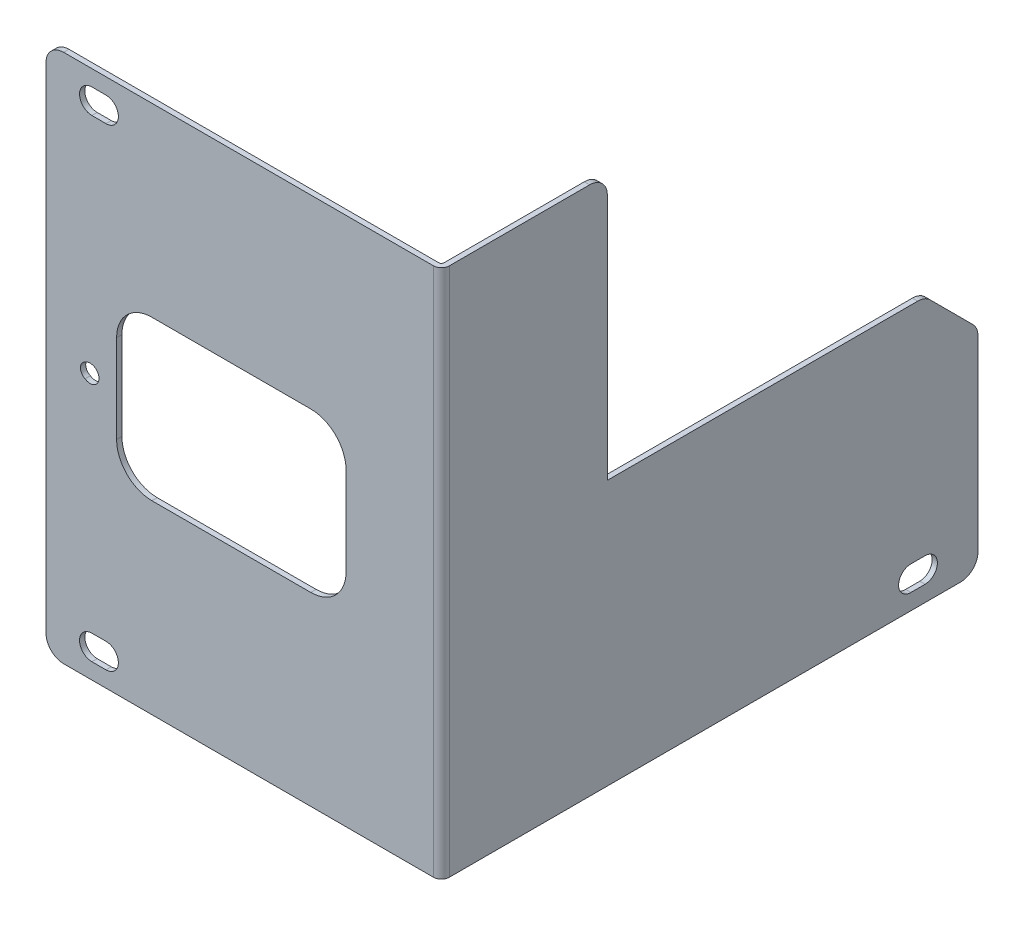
ISO-10303-21;
HEADER;
FILE_DESCRIPTION(('STEP AP214'),'2;1');
FILE_NAME('part.step','',(''),(''),'','','');
FILE_SCHEMA(('AUTOMOTIVE_DESIGN { 1 0 10303 214 1 1 1 1 }'));
ENDSEC;
DATA;
#1=APPLICATION_CONTEXT('core data for automotive mechanical design processes');
#2=APPLICATION_PROTOCOL_DEFINITION('international standard','automotive_design',2000,#1);
#3=PRODUCT_CONTEXT('',#1,'mechanical');
#4=PRODUCT('Part','Part','',(#3));
#5=PRODUCT_RELATED_PRODUCT_CATEGORY('part','',(#4));
#6=PRODUCT_DEFINITION_FORMATION('','',#4);
#7=PRODUCT_DEFINITION_CONTEXT('part definition',#1,'design');
#8=PRODUCT_DEFINITION('design','',#6,#7);
#9=PRODUCT_DEFINITION_SHAPE('','',#8);
#10=(LENGTH_UNIT() NAMED_UNIT(*) SI_UNIT(.MILLI.,.METRE.));
#11=(NAMED_UNIT(*) PLANE_ANGLE_UNIT() SI_UNIT($,.RADIAN.));
#12=(NAMED_UNIT(*) SI_UNIT($,.STERADIAN.) SOLID_ANGLE_UNIT());
#13=UNCERTAINTY_MEASURE_WITH_UNIT(LENGTH_MEASURE(1.E-05),#10,'distance_accuracy_value','');
#14=(GEOMETRIC_REPRESENTATION_CONTEXT(3) GLOBAL_UNCERTAINTY_ASSIGNED_CONTEXT((#13)) GLOBAL_UNIT_ASSIGNED_CONTEXT((#10,
#11,#12)) REPRESENTATION_CONTEXT('',''));
#15=CARTESIAN_POINT('',(0.,0.,0.));
#16=DIRECTION('',(0.,0.,1.));
#17=DIRECTION('',(1.,0.,0.));
#18=AXIS2_PLACEMENT_3D('',#15,#16,#17);
#19=CARTESIAN_POINT('',(0.,0.,0.));
#20=DIRECTION('',(1.,0.,0.));
#21=DIRECTION('',(0.,0.,-1.));
#22=AXIS2_PLACEMENT_3D('',#19,#20,#21);
#23=PLANE('',#22);
#24=DIRECTION('',(0.,0.,-1.));
#25=VECTOR('',#24,1.);
#26=CARTESIAN_POINT('',(0.,-63.5,-131.5));
#27=LINE('',#26,#25);
#28=CARTESIAN_POINT('',(0.,-63.5,-131.5));
#29=VERTEX_POINT('',#28);
#30=CARTESIAN_POINT('',(0.,-63.5,-135.5));
#31=VERTEX_POINT('',#30);
#32=EDGE_CURVE('E891',#29,#31,#27,.T.);
#33=ORIENTED_EDGE('',*,*,#32,.F.);
#34=CARTESIAN_POINT('',(0.,-67.,-131.5));
#35=DIRECTION('',(-1.,0.,0.));
#36=DIRECTION('',(0.,0.,1.));
#37=AXIS2_PLACEMENT_3D('',#34,#35,#36);
#38=CIRCLE('',#37,3.5);
#39=CARTESIAN_POINT('',(0.,-70.5,-131.5));
#40=VERTEX_POINT('',#39);
#41=EDGE_CURVE('E888',#40,#29,#38,.T.);
#42=ORIENTED_EDGE('',*,*,#41,.F.);
#43=DIRECTION('',(0.,0.,1.));
#44=VECTOR('',#43,1.);
#45=CARTESIAN_POINT('',(0.,-70.5,-135.5));
#46=LINE('',#45,#44);
#47=CARTESIAN_POINT('',(0.,-70.5,-135.5));
#48=VERTEX_POINT('',#47);
#49=EDGE_CURVE('E889',#48,#40,#46,.T.);
#50=ORIENTED_EDGE('',*,*,#49,.F.);
#51=CARTESIAN_POINT('',(0.,-67.,-135.5));
#52=DIRECTION('',(-1.,0.,0.));
#53=DIRECTION('',(0.,0.,1.));
#54=AXIS2_PLACEMENT_3D('',#51,#52,#53);
#55=CIRCLE('',#54,3.5);
#56=EDGE_CURVE('E879',#31,#48,#55,.T.);
#57=ORIENTED_EDGE('',*,*,#56,.F.);
#58=EDGE_LOOP('',(#33,#42,#50,#57));
#59=FACE_BOUND('',#58,.T.);
#60=DIRECTION('',(0.,0.,1.));
#61=VECTOR('',#60,1.);
#62=CARTESIAN_POINT('',(0.,75.,1.50000000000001));
#63=LINE('',#62,#61);
#64=CARTESIAN_POINT('',(0.,75.,-40.5));
#65=VERTEX_POINT('',#64);
#66=CARTESIAN_POINT('',(0.,75.,-0.75));
#67=VERTEX_POINT('',#66);
#68=EDGE_CURVE('E327',#65,#67,#63,.T.);
#69=ORIENTED_EDGE('',*,*,#68,.F.);
#70=CARTESIAN_POINT('',(0.,70.,-40.5));
#71=DIRECTION('',(1.,0.,0.));
#72=DIRECTION('',(0.,0.,-1.));
#73=AXIS2_PLACEMENT_3D('',#70,#71,#72);
#74=CIRCLE('',#73,5.);
#75=CARTESIAN_POINT('',(0.,70.,-45.5));
#76=VERTEX_POINT('',#75);
#77=EDGE_CURVE('E909',#65,#76,#74,.F.);
#78=ORIENTED_EDGE('',*,*,#77,.T.);
#79=DIRECTION('',(0.,-1.,0.));
#80=VECTOR('',#79,1.);
#81=CARTESIAN_POINT('',(0.,75.,-45.5));
#82=LINE('',#81,#80);
#83=CARTESIAN_POINT('',(0.,0.,-45.5));
#84=VERTEX_POINT('',#83);
#85=EDGE_CURVE('E335',#76,#84,#82,.T.);
#86=ORIENTED_EDGE('',*,*,#85,.T.);
#87=DIRECTION('',(0.,0.,1.));
#88=VECTOR('',#87,1.);
#89=CARTESIAN_POINT('',(0.,0.,-135.5));
#90=LINE('',#89,#88);
#91=CARTESIAN_POINT('',(0.,0.,-133.428932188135));
#92=VERTEX_POINT('',#91);
#93=EDGE_CURVE('E367',#92,#84,#90,.T.);
#94=ORIENTED_EDGE('',*,*,#93,.F.);
#95=CARTESIAN_POINT('',(0.,-4.99999999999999,-133.428932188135));
#96=DIRECTION('',(1.,0.,0.));
#97=DIRECTION('',(0.,0.,-1.));
#98=AXIS2_PLACEMENT_3D('',#95,#96,#97);
#99=CIRCLE('',#98,5.);
#100=CARTESIAN_POINT('',(0.,-1.46446609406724,-136.964466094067));
#101=VERTEX_POINT('',#100);
#102=EDGE_CURVE('E913',#92,#101,#99,.F.);
#103=ORIENTED_EDGE('',*,*,#102,.T.);
#104=DIRECTION('',(0.,0.707106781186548,0.707106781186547));
#105=VECTOR('',#104,1.);
#106=CARTESIAN_POINT('',(0.,-15.,-150.5));
#107=LINE('',#106,#105);
#108=CARTESIAN_POINT('',(0.,-13.5355339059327,-149.035533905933));
#109=VERTEX_POINT('',#108);
#110=EDGE_CURVE('E931',#109,#101,#107,.T.);
#111=ORIENTED_EDGE('',*,*,#110,.F.);
#112=CARTESIAN_POINT('',(0.,-17.0710678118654,-145.5));
#113=DIRECTION('',(1.,0.,0.));
#114=DIRECTION('',(0.,0.,-1.));
#115=AXIS2_PLACEMENT_3D('',#112,#113,#114);
#116=CIRCLE('',#115,5.);
#117=CARTESIAN_POINT('',(0.,-17.0710678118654,-150.5));
#118=VERTEX_POINT('',#117);
#119=EDGE_CURVE('E925',#109,#118,#116,.F.);
#120=ORIENTED_EDGE('',*,*,#119,.T.);
#121=DIRECTION('',(0.,1.,0.));
#122=VECTOR('',#121,1.);
#123=CARTESIAN_POINT('',(0.,-75.,-150.5));
#124=LINE('',#123,#122);
#125=CARTESIAN_POINT('',(0.,-70.,-150.5));
#126=VERTEX_POINT('',#125);
#127=EDGE_CURVE('E366',#126,#118,#124,.T.);
#128=ORIENTED_EDGE('',*,*,#127,.F.);
#129=CARTESIAN_POINT('',(0.,-70.,-145.5));
#130=DIRECTION('',(1.,0.,0.));
#131=DIRECTION('',(0.,0.,-1.));
#132=AXIS2_PLACEMENT_3D('',#129,#130,#131);
#133=CIRCLE('',#132,5.);
#134=CARTESIAN_POINT('',(0.,-75.,-145.5));
#135=VERTEX_POINT('',#134);
#136=EDGE_CURVE('E912',#126,#135,#133,.F.);
#137=ORIENTED_EDGE('',*,*,#136,.T.);
#138=DIRECTION('',(0.,0.,-1.));
#139=VECTOR('',#138,1.);
#140=CARTESIAN_POINT('',(0.,-75.,1.5));
#141=LINE('',#140,#139);
#142=CARTESIAN_POINT('',(0.,-75.,-0.75));
#143=VERTEX_POINT('',#142);
#144=EDGE_CURVE('E362',#143,#135,#141,.T.);
#145=ORIENTED_EDGE('',*,*,#144,.F.);
#146=DIRECTION('',(0.,-1.,0.));
#147=VECTOR('',#146,1.);
#148=CARTESIAN_POINT('',(0.,75.,-0.75));
#149=LINE('',#148,#147);
#150=EDGE_CURVE('E361',#143,#67,#149,.F.);
#151=ORIENTED_EDGE('',*,*,#150,.T.);
#152=EDGE_LOOP('',(#69,#78,#86,#94,#103,#111,#120,#128,#137,#145,#151));
#153=FACE_BOUND('',#152,.T.);
#154=ADVANCED_FACE('F32',(#59,#153),#23,.F.);
#155=CARTESIAN_POINT('',(0.,-15.,-150.5));
#156=DIRECTION('',(0.,0.707106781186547,-0.707106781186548));
#157=DIRECTION('',(0.,0.707106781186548,0.707106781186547));
#158=AXIS2_PLACEMENT_3D('',#155,#156,#157);
#159=PLANE('',#158);
#160=DIRECTION('',(0.,0.707106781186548,0.707106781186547));
#161=VECTOR('',#160,1.);
#162=CARTESIAN_POINT('',(1.5,-15.,-150.5));
#163=LINE('',#162,#161);
#164=CARTESIAN_POINT('',(1.5,-13.5355339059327,-149.035533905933));
#165=VERTEX_POINT('',#164);
#166=CARTESIAN_POINT('',(1.5,-1.46446609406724,-136.964466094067));
#167=VERTEX_POINT('',#166);
#168=EDGE_CURVE('E375',#165,#167,#163,.T.);
#169=ORIENTED_EDGE('',*,*,#168,.F.);
#170=DIRECTION('',(1.,0.,0.));
#171=VECTOR('',#170,1.);
#172=CARTESIAN_POINT('',(0.,-13.5355339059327,-149.035533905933));
#173=LINE('',#172,#171);
#174=EDGE_CURVE('E405',#165,#109,#173,.F.);
#175=ORIENTED_EDGE('',*,*,#174,.T.);
#176=ORIENTED_EDGE('',*,*,#110,.T.);
#177=DIRECTION('',(1.,0.,0.));
#178=VECTOR('',#177,1.);
#179=CARTESIAN_POINT('',(0.,-1.46446609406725,-136.964466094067));
#180=LINE('',#179,#178);
#181=EDGE_CURVE('E402',#101,#167,#180,.T.);
#182=ORIENTED_EDGE('',*,*,#181,.T.);
#183=EDGE_LOOP('',(#169,#175,#176,#182));
#184=FACE_BOUND('',#183,.T.);
#185=ADVANCED_FACE('F588',(#184),#159,.T.);
#186=CARTESIAN_POINT('',(0.,-75.,-150.5));
#187=DIRECTION('',(0.,0.,-1.));
#188=DIRECTION('',(-1.,0.,0.));
#189=AXIS2_PLACEMENT_3D('',#186,#187,#188);
#190=PLANE('',#189);
#191=ORIENTED_EDGE('',*,*,#127,.T.);
#192=DIRECTION('',(1.,0.,0.));
#193=VECTOR('',#192,1.);
#194=CARTESIAN_POINT('',(0.,-17.0710678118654,-150.5));
#195=LINE('',#194,#193);
#196=CARTESIAN_POINT('',(1.5,-17.0710678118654,-150.5));
#197=VERTEX_POINT('',#196);
#198=EDGE_CURVE('E399',#118,#197,#195,.T.);
#199=ORIENTED_EDGE('',*,*,#198,.T.);
#200=DIRECTION('',(0.,1.,0.));
#201=VECTOR('',#200,1.);
#202=CARTESIAN_POINT('',(1.5,-75.,-150.5));
#203=LINE('',#202,#201);
#204=CARTESIAN_POINT('',(1.5,-70.,-150.5));
#205=VERTEX_POINT('',#204);
#206=EDGE_CURVE('E937',#205,#197,#203,.T.);
#207=ORIENTED_EDGE('',*,*,#206,.F.);
#208=DIRECTION('',(1.,0.,0.));
#209=VECTOR('',#208,1.);
#210=CARTESIAN_POINT('',(0.,-70.,-150.5));
#211=LINE('',#210,#209);
#212=EDGE_CURVE('E397',#205,#126,#211,.F.);
#213=ORIENTED_EDGE('',*,*,#212,.T.);
#214=EDGE_LOOP('',(#191,#199,#207,#213));
#215=FACE_BOUND('',#214,.T.);
#216=ADVANCED_FACE('F594',(#215),#190,.T.);
#217=CARTESIAN_POINT('',(0.,-75.,1.5));
#218=DIRECTION('',(0.,-1.,0.));
#219=DIRECTION('',(0.,0.,-1.));
#220=AXIS2_PLACEMENT_3D('',#217,#218,#219);
#221=PLANE('',#220);
#222=DIRECTION('',(1.,0.,0.));
#223=VECTOR('',#222,1.);
#224=CARTESIAN_POINT('',(0.,-75.,1.5));
#225=LINE('',#224,#223);
#226=CARTESIAN_POINT('',(-105.5,-75.,1.5));
#227=VERTEX_POINT('',#226);
#228=CARTESIAN_POINT('',(-0.75,-75.,1.5));
#229=VERTEX_POINT('',#228);
#230=EDGE_CURVE('E351',#227,#229,#225,.T.);
#231=ORIENTED_EDGE('',*,*,#230,.F.);
#232=DIRECTION('',(0.,0.,1.));
#233=VECTOR('',#232,1.);
#234=CARTESIAN_POINT('',(-105.5,-75.,0.));
#235=LINE('',#234,#233);
#236=CARTESIAN_POINT('',(-105.5,-75.,0.));
#237=VERTEX_POINT('',#236);
#238=EDGE_CURVE('E423',#227,#237,#235,.F.);
#239=ORIENTED_EDGE('',*,*,#238,.T.);
#240=DIRECTION('',(1.,0.,0.));
#241=VECTOR('',#240,1.);
#242=CARTESIAN_POINT('',(-110.5,-75.,0.));
#243=LINE('',#242,#241);
#244=CARTESIAN_POINT('',(-0.750000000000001,-75.,0.));
#245=VERTEX_POINT('',#244);
#246=EDGE_CURVE('E320',#237,#245,#243,.T.);
#247=ORIENTED_EDGE('',*,*,#246,.T.);
#248=CARTESIAN_POINT('',(-0.750000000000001,-75.,-0.75));
#249=DIRECTION('',(0.,-1.,0.));
#250=DIRECTION('',(0.,0.,-1.));
#251=AXIS2_PLACEMENT_3D('',#248,#249,#250);
#252=CIRCLE('',#251,0.75);
#253=EDGE_CURVE('E950',#245,#143,#252,.F.);
#254=ORIENTED_EDGE('',*,*,#253,.T.);
#255=ORIENTED_EDGE('',*,*,#144,.T.);
#256=DIRECTION('',(1.,0.,0.));
#257=VECTOR('',#256,1.);
#258=CARTESIAN_POINT('',(0.,-75.,-145.5));
#259=LINE('',#258,#257);
#260=CARTESIAN_POINT('',(1.5,-75.,-145.5));
#261=VERTEX_POINT('',#260);
#262=EDGE_CURVE('E419',#135,#261,#259,.T.);
#263=ORIENTED_EDGE('',*,*,#262,.T.);
#264=DIRECTION('',(0.,0.,-1.));
#265=VECTOR('',#264,1.);
#266=CARTESIAN_POINT('',(1.5,-75.,1.5));
#267=LINE('',#266,#265);
#268=CARTESIAN_POINT('',(1.5,-75.,-0.75));
#269=VERTEX_POINT('',#268);
#270=EDGE_CURVE('E382',#269,#261,#267,.T.);
#271=ORIENTED_EDGE('',*,*,#270,.F.);
#272=CARTESIAN_POINT('',(-0.75,-75.,-0.75));
#273=DIRECTION('',(0.,-1.,0.));
#274=DIRECTION('',(0.,0.,-1.));
#275=AXIS2_PLACEMENT_3D('',#272,#273,#274);
#276=CIRCLE('',#275,2.25);
#277=EDGE_CURVE('E972',#269,#229,#276,.T.);
#278=ORIENTED_EDGE('',*,*,#277,.T.);
#279=EDGE_LOOP('',(#231,#239,#247,#254,#255,#263,#271,#278));
#280=FACE_BOUND('',#279,.T.);
#281=ADVANCED_FACE('F610',(#280),#221,.T.);
#282=CARTESIAN_POINT('',(0.,0.,1.5));
#283=DIRECTION('',(0.,0.,1.));
#284=DIRECTION('',(1.,0.,0.));
#285=AXIS2_PLACEMENT_3D('',#282,#283,#284);
#286=PLANE('',#285);
#287=CARTESIAN_POINT('',(-98.,0.,1.5));
#288=DIRECTION('',(0.,0.,-1.));
#289=DIRECTION('',(-1.,0.,0.));
#290=AXIS2_PLACEMENT_3D('',#287,#288,#289);
#291=CIRCLE('',#290,2.5);
#292=CARTESIAN_POINT('',(-99.4375000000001,2.04538352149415,1.5));
#293=VERTEX_POINT('',#292);
#294=CARTESIAN_POINT('',(-99.4375000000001,-2.04538352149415,1.5));
#295=VERTEX_POINT('',#294);
#296=EDGE_CURVE('E289',#293,#295,#291,.T.);
#297=ORIENTED_EDGE('',*,*,#296,.T.);
#298=CARTESIAN_POINT('',(-98.5,0.,1.5));
#299=DIRECTION('',(0.,0.,-1.));
#300=DIRECTION('',(-1.,0.,0.));
#301=AXIS2_PLACEMENT_3D('',#298,#299,#300);
#302=CIRCLE('',#301,2.24999999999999);
#303=EDGE_CURVE('E304',#295,#293,#302,.T.);
#304=ORIENTED_EDGE('',*,*,#303,.T.);
#305=EDGE_LOOP('',(#297,#304));
#306=FACE_BOUND('',#305,.T.);
#307=DIRECTION('',(0.,1.,0.));
#308=VECTOR('',#307,1.);
#309=CARTESIAN_POINT('',(-90.5,-22.5,1.50000000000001));
#310=LINE('',#309,#308);
#311=CARTESIAN_POINT('',(-90.5,-12.5,1.50000000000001));
#312=VERTEX_POINT('',#311);
#313=CARTESIAN_POINT('',(-90.5,12.5,1.50000000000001));
#314=VERTEX_POINT('',#313);
#315=EDGE_CURVE('E479',#312,#314,#310,.T.);
#316=ORIENTED_EDGE('',*,*,#315,.T.);
#317=CARTESIAN_POINT('',(-80.5,12.5,1.5));
#318=DIRECTION('',(0.,0.,1.));
#319=DIRECTION('',(1.,0.,0.));
#320=AXIS2_PLACEMENT_3D('',#317,#318,#319);
#321=CIRCLE('',#320,10.);
#322=CARTESIAN_POINT('',(-80.5,22.5,1.50000000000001));
#323=VERTEX_POINT('',#322);
#324=EDGE_CURVE('E11',#314,#323,#321,.F.);
#325=ORIENTED_EDGE('',*,*,#324,.T.);
#326=DIRECTION('',(1.,0.,0.));
#327=VECTOR('',#326,1.);
#328=CARTESIAN_POINT('',(-90.5,22.5,1.50000000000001));
#329=LINE('',#328,#327);
#330=CARTESIAN_POINT('',(-35.5,22.5,1.50000000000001));
#331=VERTEX_POINT('',#330);
#332=EDGE_CURVE('E470',#323,#331,#329,.T.);
#333=ORIENTED_EDGE('',*,*,#332,.T.);
#334=CARTESIAN_POINT('',(-35.5,12.5,1.5));
#335=DIRECTION('',(0.,0.,1.));
#336=DIRECTION('',(1.,0.,0.));
#337=AXIS2_PLACEMENT_3D('',#334,#335,#336);
#338=CIRCLE('',#337,10.);
#339=CARTESIAN_POINT('',(-25.5,12.5,1.50000000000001));
#340=VERTEX_POINT('',#339);
#341=EDGE_CURVE('E450',#331,#340,#338,.F.);
#342=ORIENTED_EDGE('',*,*,#341,.T.);
#343=DIRECTION('',(0.,-1.,0.));
#344=VECTOR('',#343,1.);
#345=CARTESIAN_POINT('',(-25.5,22.5,1.50000000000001));
#346=LINE('',#345,#344);
#347=CARTESIAN_POINT('',(-25.5,-12.5,1.50000000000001));
#348=VERTEX_POINT('',#347);
#349=EDGE_CURVE('E483',#340,#348,#346,.T.);
#350=ORIENTED_EDGE('',*,*,#349,.T.);
#351=CARTESIAN_POINT('',(-35.5,-12.5,1.5));
#352=DIRECTION('',(0.,0.,1.));
#353=DIRECTION('',(1.,0.,0.));
#354=AXIS2_PLACEMENT_3D('',#351,#352,#353);
#355=CIRCLE('',#354,10.);
#356=CARTESIAN_POINT('',(-35.5,-22.5,1.50000000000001));
#357=VERTEX_POINT('',#356);
#358=EDGE_CURVE('E454',#348,#357,#355,.F.);
#359=ORIENTED_EDGE('',*,*,#358,.T.);
#360=DIRECTION('',(-1.,0.,0.));
#361=VECTOR('',#360,1.);
#362=CARTESIAN_POINT('',(-25.5,-22.5,1.50000000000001));
#363=LINE('',#362,#361);
#364=CARTESIAN_POINT('',(-80.5,-22.5,1.50000000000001));
#365=VERTEX_POINT('',#364);
#366=EDGE_CURVE('E486',#357,#365,#363,.T.);
#367=ORIENTED_EDGE('',*,*,#366,.T.);
#368=CARTESIAN_POINT('',(-80.5,-12.5,1.5));
#369=DIRECTION('',(0.,0.,1.));
#370=DIRECTION('',(1.,0.,0.));
#371=AXIS2_PLACEMENT_3D('',#368,#369,#370);
#372=CIRCLE('',#371,10.);
#373=EDGE_CURVE('E54',#365,#312,#372,.F.);
#374=ORIENTED_EDGE('',*,*,#373,.T.);
#375=EDGE_LOOP('',(#316,#325,#333,#342,#350,#359,#367,#374));
#376=FACE_BOUND('',#375,.T.);
#377=CARTESIAN_POINT('',(-97.5,67.,1.50000000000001));
#378=DIRECTION('',(0.,0.,-1.));
#379=DIRECTION('',(-1.,0.,0.));
#380=AXIS2_PLACEMENT_3D('',#377,#378,#379);
#381=CIRCLE('',#380,3.5);
#382=CARTESIAN_POINT('',(-97.5,63.5,1.50000000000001));
#383=VERTEX_POINT('',#382);
#384=CARTESIAN_POINT('',(-97.5,70.5,1.50000000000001));
#385=VERTEX_POINT('',#384);
#386=EDGE_CURVE('E502',#383,#385,#381,.T.);
#387=ORIENTED_EDGE('',*,*,#386,.T.);
#388=DIRECTION('',(1.,0.,0.));
#389=VECTOR('',#388,1.);
#390=CARTESIAN_POINT('',(-97.5,70.5,1.50000000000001));
#391=LINE('',#390,#389);
#392=CARTESIAN_POINT('',(-93.5,70.5,1.5));
#393=VERTEX_POINT('',#392);
#394=EDGE_CURVE('E505',#385,#393,#391,.T.);
#395=ORIENTED_EDGE('',*,*,#394,.T.);
#396=CARTESIAN_POINT('',(-93.5,67.,1.50000000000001));
#397=DIRECTION('',(0.,0.,-1.));
#398=DIRECTION('',(-1.,0.,0.));
#399=AXIS2_PLACEMENT_3D('',#396,#397,#398);
#400=CIRCLE('',#399,3.5);
#401=CARTESIAN_POINT('',(-93.5,63.5,1.50000000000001));
#402=VERTEX_POINT('',#401);
#403=EDGE_CURVE('E509',#393,#402,#400,.T.);
#404=ORIENTED_EDGE('',*,*,#403,.T.);
#405=DIRECTION('',(-1.,0.,0.));
#406=VECTOR('',#405,1.);
#407=CARTESIAN_POINT('',(-93.5,63.5,1.50000000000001));
#408=LINE('',#407,#406);
#409=EDGE_CURVE('E512',#402,#383,#408,.T.);
#410=ORIENTED_EDGE('',*,*,#409,.T.);
#411=EDGE_LOOP('',(#387,#395,#404,#410));
#412=FACE_BOUND('',#411,.T.);
#413=CARTESIAN_POINT('',(-97.5,-67.,1.50000000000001));
#414=DIRECTION('',(0.,0.,-1.));
#415=DIRECTION('',(-1.,0.,0.));
#416=AXIS2_PLACEMENT_3D('',#413,#414,#415);
#417=CIRCLE('',#416,3.5);
#418=CARTESIAN_POINT('',(-97.5,-70.5,1.50000000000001));
#419=VERTEX_POINT('',#418);
#420=CARTESIAN_POINT('',(-97.5,-63.5,1.50000000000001));
#421=VERTEX_POINT('',#420);
#422=EDGE_CURVE('E534',#419,#421,#417,.T.);
#423=ORIENTED_EDGE('',*,*,#422,.T.);
#424=DIRECTION('',(1.,0.,0.));
#425=VECTOR('',#424,1.);
#426=CARTESIAN_POINT('',(-97.5,-63.5,1.50000000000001));
#427=LINE('',#426,#425);
#428=CARTESIAN_POINT('',(-93.5,-63.5,1.5));
#429=VERTEX_POINT('',#428);
#430=EDGE_CURVE('E537',#421,#429,#427,.T.);
#431=ORIENTED_EDGE('',*,*,#430,.T.);
#432=CARTESIAN_POINT('',(-93.5,-67.,1.50000000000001));
#433=DIRECTION('',(0.,0.,-1.));
#434=DIRECTION('',(-1.,0.,0.));
#435=AXIS2_PLACEMENT_3D('',#432,#433,#434);
#436=CIRCLE('',#435,3.5);
#437=CARTESIAN_POINT('',(-93.5,-70.5,1.50000000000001));
#438=VERTEX_POINT('',#437);
#439=EDGE_CURVE('E541',#429,#438,#436,.T.);
#440=ORIENTED_EDGE('',*,*,#439,.T.);
#441=DIRECTION('',(-1.,0.,0.));
#442=VECTOR('',#441,1.);
#443=CARTESIAN_POINT('',(-93.5,-70.5,1.50000000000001));
#444=LINE('',#443,#442);
#445=EDGE_CURVE('E544',#438,#419,#444,.T.);
#446=ORIENTED_EDGE('',*,*,#445,.T.);
#447=EDGE_LOOP('',(#423,#431,#440,#446));
#448=FACE_BOUND('',#447,.T.);
#449=DIRECTION('',(0.,1.,0.));
#450=VECTOR('',#449,1.);
#451=CARTESIAN_POINT('',(-110.5,75.,1.5));
#452=LINE('',#451,#450);
#453=CARTESIAN_POINT('',(-110.5,-70.,1.5));
#454=VERTEX_POINT('',#453);
#455=CARTESIAN_POINT('',(-110.5,70.,1.5));
#456=VERTEX_POINT('',#455);
#457=EDGE_CURVE('E317',#454,#456,#452,.T.);
#458=ORIENTED_EDGE('',*,*,#457,.F.);
#459=CARTESIAN_POINT('',(-105.5,-70.,1.5));
#460=DIRECTION('',(0.,0.,1.));
#461=DIRECTION('',(1.,0.,0.));
#462=AXIS2_PLACEMENT_3D('',#459,#460,#461);
#463=CIRCLE('',#462,5.);
#464=EDGE_CURVE('E417',#454,#227,#463,.T.);
#465=ORIENTED_EDGE('',*,*,#464,.T.);
#466=ORIENTED_EDGE('',*,*,#230,.T.);
#467=DIRECTION('',(0.,-1.,0.));
#468=VECTOR('',#467,1.);
#469=CARTESIAN_POINT('',(-0.75,0.,1.5));
#470=LINE('',#469,#468);
#471=CARTESIAN_POINT('',(-0.75,75.,1.50000000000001));
#472=VERTEX_POINT('',#471);
#473=EDGE_CURVE('E965',#229,#472,#470,.F.);
#474=ORIENTED_EDGE('',*,*,#473,.T.);
#475=DIRECTION('',(1.,0.,0.));
#476=VECTOR('',#475,1.);
#477=CARTESIAN_POINT('',(1.5,75.,1.50000000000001));
#478=LINE('',#477,#476);
#479=CARTESIAN_POINT('',(-105.5,75.,1.50000000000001));
#480=VERTEX_POINT('',#479);
#481=EDGE_CURVE('E321',#480,#472,#478,.T.);
#482=ORIENTED_EDGE('',*,*,#481,.F.);
#483=CARTESIAN_POINT('',(-105.5,70.,1.5));
#484=DIRECTION('',(0.,0.,1.));
#485=DIRECTION('',(1.,0.,0.));
#486=AXIS2_PLACEMENT_3D('',#483,#484,#485);
#487=CIRCLE('',#486,5.);
#488=EDGE_CURVE('E415',#480,#456,#487,.T.);
#489=ORIENTED_EDGE('',*,*,#488,.T.);
#490=EDGE_LOOP('',(#458,#465,#466,#474,#482,#489));
#491=FACE_BOUND('',#490,.T.);
#492=ADVANCED_FACE('F476',(#306,#376,#412,#448,#491),#286,.T.);
#493=CARTESIAN_POINT('',(0.,0.,-135.5));
#494=DIRECTION('',(0.,1.,0.));
#495=DIRECTION('',(0.,0.,1.));
#496=AXIS2_PLACEMENT_3D('',#493,#494,#495);
#497=PLANE('',#496);
#498=DIRECTION('',(0.,0.,1.));
#499=VECTOR('',#498,1.);
#500=CARTESIAN_POINT('',(1.5,0.,-135.5));
#501=LINE('',#500,#499);
#502=CARTESIAN_POINT('',(1.5,0.,-133.428932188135));
#503=VERTEX_POINT('',#502);
#504=CARTESIAN_POINT('',(1.5,0.,-45.5));
#505=VERTEX_POINT('',#504);
#506=EDGE_CURVE('E378',#503,#505,#501,.T.);
#507=ORIENTED_EDGE('',*,*,#506,.F.);
#508=DIRECTION('',(1.,0.,0.));
#509=VECTOR('',#508,1.);
#510=CARTESIAN_POINT('',(0.,0.,-133.428932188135));
#511=LINE('',#510,#509);
#512=EDGE_CURVE('E407',#503,#92,#511,.F.);
#513=ORIENTED_EDGE('',*,*,#512,.T.);
#514=ORIENTED_EDGE('',*,*,#93,.T.);
#515=DIRECTION('',(-1.,0.,0.));
#516=VECTOR('',#515,1.);
#517=CARTESIAN_POINT('',(0.,0.,-45.5));
#518=LINE('',#517,#516);
#519=EDGE_CURVE('E324',#505,#84,#518,.T.);
#520=ORIENTED_EDGE('',*,*,#519,.F.);
#521=EDGE_LOOP('',(#507,#513,#514,#520));
#522=FACE_BOUND('',#521,.T.);
#523=ADVANCED_FACE('F606',(#522),#497,.T.);
#524=CARTESIAN_POINT('',(1.5,0.,0.));
#525=DIRECTION('',(1.,0.,0.));
#526=DIRECTION('',(0.,0.,-1.));
#527=AXIS2_PLACEMENT_3D('',#524,#525,#526);
#528=PLANE('',#527);
#529=CARTESIAN_POINT('',(1.5,-67.,-131.5));
#530=DIRECTION('',(1.,0.,0.));
#531=DIRECTION('',(0.,0.,-1.));
#532=AXIS2_PLACEMENT_3D('',#529,#530,#531);
#533=CIRCLE('',#532,3.5);
#534=CARTESIAN_POINT('',(1.5,-63.5,-131.5));
#535=VERTEX_POINT('',#534);
#536=CARTESIAN_POINT('',(1.5,-70.5,-131.5));
#537=VERTEX_POINT('',#536);
#538=EDGE_CURVE('E295',#535,#537,#533,.T.);
#539=ORIENTED_EDGE('',*,*,#538,.F.);
#540=DIRECTION('',(0.,0.,1.));
#541=VECTOR('',#540,1.);
#542=CARTESIAN_POINT('',(1.5,-63.5,0.));
#543=LINE('',#542,#541);
#544=CARTESIAN_POINT('',(1.5,-63.5,-135.5));
#545=VERTEX_POINT('',#544);
#546=EDGE_CURVE('E348',#545,#535,#543,.T.);
#547=ORIENTED_EDGE('',*,*,#546,.F.);
#548=CARTESIAN_POINT('',(1.5,-67.,-135.5));
#549=DIRECTION('',(1.,0.,0.));
#550=DIRECTION('',(0.,0.,-1.));
#551=AXIS2_PLACEMENT_3D('',#548,#549,#550);
#552=CIRCLE('',#551,3.5);
#553=CARTESIAN_POINT('',(1.5,-70.5,-135.5));
#554=VERTEX_POINT('',#553);
#555=EDGE_CURVE('E350',#554,#545,#552,.T.);
#556=ORIENTED_EDGE('',*,*,#555,.F.);
#557=DIRECTION('',(0.,0.,-1.));
#558=VECTOR('',#557,1.);
#559=CARTESIAN_POINT('',(1.5,-70.5,0.));
#560=LINE('',#559,#558);
#561=EDGE_CURVE('E354',#537,#554,#560,.T.);
#562=ORIENTED_EDGE('',*,*,#561,.F.);
#563=EDGE_LOOP('',(#539,#547,#556,#562));
#564=FACE_BOUND('',#563,.T.);
#565=DIRECTION('',(0.,-1.,0.));
#566=VECTOR('',#565,1.);
#567=CARTESIAN_POINT('',(1.5,75.,-45.5));
#568=LINE('',#567,#566);
#569=CARTESIAN_POINT('',(1.5,70.,-45.5));
#570=VERTEX_POINT('',#569);
#571=EDGE_CURVE('E379',#570,#505,#568,.T.);
#572=ORIENTED_EDGE('',*,*,#571,.F.);
#573=CARTESIAN_POINT('',(1.5,70.,-40.5));
#574=DIRECTION('',(1.,0.,0.));
#575=DIRECTION('',(0.,0.,-1.));
#576=AXIS2_PLACEMENT_3D('',#573,#574,#575);
#577=CIRCLE('',#576,5.);
#578=CARTESIAN_POINT('',(1.5,75.,-40.5));
#579=VERTEX_POINT('',#578);
#580=EDGE_CURVE('E395',#570,#579,#577,.T.);
#581=ORIENTED_EDGE('',*,*,#580,.T.);
#582=DIRECTION('',(0.,0.,-1.));
#583=VECTOR('',#582,1.);
#584=CARTESIAN_POINT('',(1.5,75.,-45.5));
#585=LINE('',#584,#583);
#586=CARTESIAN_POINT('',(1.5,75.,-0.750000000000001));
#587=VERTEX_POINT('',#586);
#588=EDGE_CURVE('E323',#587,#579,#585,.T.);
#589=ORIENTED_EDGE('',*,*,#588,.F.);
#590=DIRECTION('',(0.,-1.,0.));
#591=VECTOR('',#590,1.);
#592=CARTESIAN_POINT('',(1.5,0.,-0.75));
#593=LINE('',#592,#591);
#594=EDGE_CURVE('E949',#587,#269,#593,.T.);
#595=ORIENTED_EDGE('',*,*,#594,.T.);
#596=ORIENTED_EDGE('',*,*,#270,.T.);
#597=CARTESIAN_POINT('',(1.5,-70.,-145.5));
#598=DIRECTION('',(1.,0.,0.));
#599=DIRECTION('',(0.,0.,-1.));
#600=AXIS2_PLACEMENT_3D('',#597,#598,#599);
#601=CIRCLE('',#600,5.);
#602=EDGE_CURVE('E389',#261,#205,#601,.T.);
#603=ORIENTED_EDGE('',*,*,#602,.T.);
#604=ORIENTED_EDGE('',*,*,#206,.T.);
#605=CARTESIAN_POINT('',(1.5,-17.0710678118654,-145.5));
#606=DIRECTION('',(1.,0.,0.));
#607=DIRECTION('',(0.,0.,-1.));
#608=AXIS2_PLACEMENT_3D('',#605,#606,#607);
#609=CIRCLE('',#608,5.);
#610=EDGE_CURVE('E393',#197,#165,#609,.T.);
#611=ORIENTED_EDGE('',*,*,#610,.T.);
#612=ORIENTED_EDGE('',*,*,#168,.T.);
#613=CARTESIAN_POINT('',(1.5,-4.99999999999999,-133.428932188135));
#614=DIRECTION('',(1.,0.,0.));
#615=DIRECTION('',(0.,0.,-1.));
#616=AXIS2_PLACEMENT_3D('',#613,#614,#615);
#617=CIRCLE('',#616,5.);
#618=EDGE_CURVE('E391',#167,#503,#617,.T.);
#619=ORIENTED_EDGE('',*,*,#618,.T.);
#620=ORIENTED_EDGE('',*,*,#506,.T.);
#621=EDGE_LOOP('',(#572,#581,#589,#595,#596,#603,#604,#611,#612,#619,#620));
#622=FACE_BOUND('',#621,.T.);
#623=ADVANCED_FACE('F603',(#564,#622),#528,.T.);
#624=CARTESIAN_POINT('',(0.,75.,-45.5));
#625=DIRECTION('',(0.,0.,1.));
#626=DIRECTION('',(0.,-1.,0.));
#627=AXIS2_PLACEMENT_3D('',#624,#625,#626);
#628=PLANE('',#627);
#629=ORIENTED_EDGE('',*,*,#85,.F.);
#630=DIRECTION('',(-1.,0.,0.));
#631=VECTOR('',#630,1.);
#632=CARTESIAN_POINT('',(0.,70.,-45.5));
#633=LINE('',#632,#631);
#634=EDGE_CURVE('E387',#76,#570,#633,.F.);
#635=ORIENTED_EDGE('',*,*,#634,.T.);
#636=ORIENTED_EDGE('',*,*,#571,.T.);
#637=ORIENTED_EDGE('',*,*,#519,.T.);
#638=EDGE_LOOP('',(#629,#635,#636,#637));
#639=FACE_BOUND('',#638,.T.);
#640=ADVANCED_FACE('F601',(#639),#628,.F.);
#641=CARTESIAN_POINT('',(0.,75.,0.));
#642=DIRECTION('',(0.,-1.,0.));
#643=DIRECTION('',(0.,0.,-1.));
#644=AXIS2_PLACEMENT_3D('',#641,#642,#643);
#645=PLANE('',#644);
#646=ORIENTED_EDGE('',*,*,#588,.T.);
#647=DIRECTION('',(-1.,0.,0.));
#648=VECTOR('',#647,1.);
#649=CARTESIAN_POINT('',(0.,75.,-40.5));
#650=LINE('',#649,#648);
#651=EDGE_CURVE('E908',#579,#65,#650,.T.);
#652=ORIENTED_EDGE('',*,*,#651,.T.);
#653=ORIENTED_EDGE('',*,*,#68,.T.);
#654=CARTESIAN_POINT('',(-0.750000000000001,75.,-0.75));
#655=DIRECTION('',(0.,-1.,0.));
#656=DIRECTION('',(0.,0.,-1.));
#657=AXIS2_PLACEMENT_3D('',#654,#655,#656);
#658=CIRCLE('',#657,0.75);
#659=CARTESIAN_POINT('',(-0.750000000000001,75.,0.));
#660=VERTEX_POINT('',#659);
#661=EDGE_CURVE('E946',#67,#660,#658,.T.);
#662=ORIENTED_EDGE('',*,*,#661,.T.);
#663=DIRECTION('',(1.,0.,0.));
#664=VECTOR('',#663,1.);
#665=CARTESIAN_POINT('',(-110.5,75.,0.));
#666=LINE('',#665,#664);
#667=CARTESIAN_POINT('',(-105.5,75.,0.));
#668=VERTEX_POINT('',#667);
#669=EDGE_CURVE('E338',#668,#660,#666,.T.);
#670=ORIENTED_EDGE('',*,*,#669,.F.);
#671=DIRECTION('',(0.,0.,-1.));
#672=VECTOR('',#671,1.);
#673=CARTESIAN_POINT('',(-105.5,75.,0.));
#674=LINE('',#673,#672);
#675=EDGE_CURVE('E341',#668,#480,#674,.F.);
#676=ORIENTED_EDGE('',*,*,#675,.T.);
#677=ORIENTED_EDGE('',*,*,#481,.T.);
#678=CARTESIAN_POINT('',(-0.75,75.,-0.75));
#679=DIRECTION('',(0.,-1.,0.));
#680=DIRECTION('',(0.,0.,-1.));
#681=AXIS2_PLACEMENT_3D('',#678,#679,#680);
#682=CIRCLE('',#681,2.25);
#683=EDGE_CURVE('E336',#472,#587,#682,.F.);
#684=ORIENTED_EDGE('',*,*,#683,.T.);
#685=EDGE_LOOP('',(#646,#652,#653,#662,#670,#676,#677,#684));
#686=FACE_BOUND('',#685,.T.);
#687=ADVANCED_FACE('F944',(#686),#645,.F.);
#688=CARTESIAN_POINT('',(-110.5,-75.,0.));
#689=DIRECTION('',(0.,0.,1.));
#690=DIRECTION('',(1.,0.,0.));
#691=AXIS2_PLACEMENT_3D('',#688,#689,#690);
#692=PLANE('',#691);
#693=DIRECTION('',(0.,-1.,0.));
#694=VECTOR('',#693,1.);
#695=CARTESIAN_POINT('',(-25.5,22.5,0.));
#696=LINE('',#695,#694);
#697=CARTESIAN_POINT('',(-25.5,12.5,0.));
#698=VERTEX_POINT('',#697);
#699=CARTESIAN_POINT('',(-25.5,-12.5,0.));
#700=VERTEX_POINT('',#699);
#701=EDGE_CURVE('E496',#698,#700,#696,.T.);
#702=ORIENTED_EDGE('',*,*,#701,.F.);
#703=CARTESIAN_POINT('',(-35.5,12.5,0.));
#704=DIRECTION('',(0.,0.,1.));
#705=DIRECTION('',(1.,0.,0.));
#706=AXIS2_PLACEMENT_3D('',#703,#704,#705);
#707=CIRCLE('',#706,10.);
#708=CARTESIAN_POINT('',(-35.5,22.5,0.));
#709=VERTEX_POINT('',#708);
#710=EDGE_CURVE('E448',#698,#709,#707,.T.);
#711=ORIENTED_EDGE('',*,*,#710,.T.);
#712=DIRECTION('',(1.,0.,0.));
#713=VECTOR('',#712,1.);
#714=CARTESIAN_POINT('',(-90.5,22.5,0.));
#715=LINE('',#714,#713);
#716=CARTESIAN_POINT('',(-80.5,22.5,0.));
#717=VERTEX_POINT('',#716);
#718=EDGE_CURVE('E465',#717,#709,#715,.T.);
#719=ORIENTED_EDGE('',*,*,#718,.F.);
#720=CARTESIAN_POINT('',(-80.5,12.5,0.));
#721=DIRECTION('',(0.,0.,1.));
#722=DIRECTION('',(1.,0.,0.));
#723=AXIS2_PLACEMENT_3D('',#720,#721,#722);
#724=CIRCLE('',#723,10.);
#725=CARTESIAN_POINT('',(-90.5,12.5,0.));
#726=VERTEX_POINT('',#725);
#727=EDGE_CURVE('E40',#717,#726,#724,.T.);
#728=ORIENTED_EDGE('',*,*,#727,.T.);
#729=DIRECTION('',(0.,1.,0.));
#730=VECTOR('',#729,1.);
#731=CARTESIAN_POINT('',(-90.5,-22.5,0.));
#732=LINE('',#731,#730);
#733=CARTESIAN_POINT('',(-90.5,-12.5,0.));
#734=VERTEX_POINT('',#733);
#735=EDGE_CURVE('E463',#734,#726,#732,.T.);
#736=ORIENTED_EDGE('',*,*,#735,.F.);
#737=CARTESIAN_POINT('',(-80.5,-12.5,0.));
#738=DIRECTION('',(0.,0.,1.));
#739=DIRECTION('',(1.,0.,0.));
#740=AXIS2_PLACEMENT_3D('',#737,#738,#739);
#741=CIRCLE('',#740,10.);
#742=CARTESIAN_POINT('',(-80.5,-22.5,0.));
#743=VERTEX_POINT('',#742);
#744=EDGE_CURVE('E456',#734,#743,#741,.T.);
#745=ORIENTED_EDGE('',*,*,#744,.T.);
#746=DIRECTION('',(-1.,0.,0.));
#747=VECTOR('',#746,1.);
#748=CARTESIAN_POINT('',(-25.5,-22.5,0.));
#749=LINE('',#748,#747);
#750=CARTESIAN_POINT('',(-35.5,-22.5,0.));
#751=VERTEX_POINT('',#750);
#752=EDGE_CURVE('E471',#751,#743,#749,.T.);
#753=ORIENTED_EDGE('',*,*,#752,.F.);
#754=CARTESIAN_POINT('',(-35.5,-12.5,0.));
#755=DIRECTION('',(0.,0.,1.));
#756=DIRECTION('',(1.,0.,0.));
#757=AXIS2_PLACEMENT_3D('',#754,#755,#756);
#758=CIRCLE('',#757,10.);
#759=EDGE_CURVE('E452',#751,#700,#758,.T.);
#760=ORIENTED_EDGE('',*,*,#759,.T.);
#761=EDGE_LOOP('',(#702,#711,#719,#728,#736,#745,#753,#760));
#762=FACE_BOUND('',#761,.T.);
#763=DIRECTION('',(1.,0.,0.));
#764=VECTOR('',#763,1.);
#765=CARTESIAN_POINT('',(-97.5,70.5,0.));
#766=LINE('',#765,#764);
#767=CARTESIAN_POINT('',(-97.5,70.5,0.));
#768=VERTEX_POINT('',#767);
#769=CARTESIAN_POINT('',(-93.5,70.5,0.));
#770=VERTEX_POINT('',#769);
#771=EDGE_CURVE('E517',#768,#770,#766,.T.);
#772=ORIENTED_EDGE('',*,*,#771,.F.);
#773=CARTESIAN_POINT('',(-97.5,67.,0.));
#774=DIRECTION('',(0.,0.,-1.));
#775=DIRECTION('',(-1.,0.,0.));
#776=AXIS2_PLACEMENT_3D('',#773,#774,#775);
#777=CIRCLE('',#776,3.5);
#778=CARTESIAN_POINT('',(-97.5,63.5,0.));
#779=VERTEX_POINT('',#778);
#780=EDGE_CURVE('E494',#779,#768,#777,.T.);
#781=ORIENTED_EDGE('',*,*,#780,.F.);
#782=DIRECTION('',(-1.,0.,0.));
#783=VECTOR('',#782,1.);
#784=CARTESIAN_POINT('',(-93.5,63.5,0.));
#785=LINE('',#784,#783);
#786=CARTESIAN_POINT('',(-93.5,63.5,0.));
#787=VERTEX_POINT('',#786);
#788=EDGE_CURVE('E506',#787,#779,#785,.T.);
#789=ORIENTED_EDGE('',*,*,#788,.F.);
#790=CARTESIAN_POINT('',(-93.5,67.,0.));
#791=DIRECTION('',(0.,0.,-1.));
#792=DIRECTION('',(-1.,0.,0.));
#793=AXIS2_PLACEMENT_3D('',#790,#791,#792);
#794=CIRCLE('',#793,3.5);
#795=EDGE_CURVE('E520',#770,#787,#794,.T.);
#796=ORIENTED_EDGE('',*,*,#795,.F.);
#797=EDGE_LOOP('',(#772,#781,#789,#796));
#798=FACE_BOUND('',#797,.T.);
#799=DIRECTION('',(1.,0.,0.));
#800=VECTOR('',#799,1.);
#801=CARTESIAN_POINT('',(-97.5,-63.5,0.));
#802=LINE('',#801,#800);
#803=CARTESIAN_POINT('',(-97.5,-63.5,0.));
#804=VERTEX_POINT('',#803);
#805=CARTESIAN_POINT('',(-93.5,-63.5,0.));
#806=VERTEX_POINT('',#805);
#807=EDGE_CURVE('E548',#804,#806,#802,.T.);
#808=ORIENTED_EDGE('',*,*,#807,.F.);
#809=CARTESIAN_POINT('',(-97.5,-67.,0.));
#810=DIRECTION('',(0.,0.,-1.));
#811=DIRECTION('',(-1.,0.,0.));
#812=AXIS2_PLACEMENT_3D('',#809,#810,#811);
#813=CIRCLE('',#812,3.5);
#814=CARTESIAN_POINT('',(-97.5,-70.5,0.));
#815=VERTEX_POINT('',#814);
#816=EDGE_CURVE('E527',#815,#804,#813,.T.);
#817=ORIENTED_EDGE('',*,*,#816,.F.);
#818=DIRECTION('',(-1.,0.,0.));
#819=VECTOR('',#818,1.);
#820=CARTESIAN_POINT('',(-93.5,-70.5,0.));
#821=LINE('',#820,#819);
#822=CARTESIAN_POINT('',(-93.5,-70.5,0.));
#823=VERTEX_POINT('',#822);
#824=EDGE_CURVE('E538',#823,#815,#821,.T.);
#825=ORIENTED_EDGE('',*,*,#824,.F.);
#826=CARTESIAN_POINT('',(-93.5,-67.,0.));
#827=DIRECTION('',(0.,0.,-1.));
#828=DIRECTION('',(-1.,0.,0.));
#829=AXIS2_PLACEMENT_3D('',#826,#827,#828);
#830=CIRCLE('',#829,3.5);
#831=EDGE_CURVE('E551',#806,#823,#830,.T.);
#832=ORIENTED_EDGE('',*,*,#831,.F.);
#833=EDGE_LOOP('',(#808,#817,#825,#832));
#834=FACE_BOUND('',#833,.T.);
#835=CARTESIAN_POINT('',(-98.5,0.,0.));
#836=DIRECTION('',(0.,0.,-1.));
#837=DIRECTION('',(-1.,0.,0.));
#838=AXIS2_PLACEMENT_3D('',#835,#836,#837);
#839=CIRCLE('',#838,2.24999999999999);
#840=CARTESIAN_POINT('',(-99.4375000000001,-2.04538352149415,0.));
#841=VERTEX_POINT('',#840);
#842=CARTESIAN_POINT('',(-99.4375000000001,2.04538352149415,0.));
#843=VERTEX_POINT('',#842);
#844=EDGE_CURVE('E301',#841,#843,#839,.T.);
#845=ORIENTED_EDGE('',*,*,#844,.F.);
#846=CARTESIAN_POINT('',(-98.,0.,0.));
#847=DIRECTION('',(0.,0.,-1.));
#848=DIRECTION('',(-1.,0.,0.));
#849=AXIS2_PLACEMENT_3D('',#846,#847,#848);
#850=CIRCLE('',#849,2.5);
#851=EDGE_CURVE('E286',#843,#841,#850,.T.);
#852=ORIENTED_EDGE('',*,*,#851,.F.);
#853=EDGE_LOOP('',(#845,#852));
#854=FACE_BOUND('',#853,.T.);
#855=ORIENTED_EDGE('',*,*,#246,.F.);
#856=CARTESIAN_POINT('',(-105.5,-70.,0.));
#857=DIRECTION('',(0.,0.,1.));
#858=DIRECTION('',(1.,0.,0.));
#859=AXIS2_PLACEMENT_3D('',#856,#857,#858);
#860=CIRCLE('',#859,5.);
#861=CARTESIAN_POINT('',(-110.5,-70.,0.));
#862=VERTEX_POINT('',#861);
#863=EDGE_CURVE('E427',#237,#862,#860,.F.);
#864=ORIENTED_EDGE('',*,*,#863,.T.);
#865=DIRECTION('',(0.,-1.,0.));
#866=VECTOR('',#865,1.);
#867=CARTESIAN_POINT('',(-110.5,-75.,0.));
#868=LINE('',#867,#866);
#869=CARTESIAN_POINT('',(-110.5,70.,0.));
#870=VERTEX_POINT('',#869);
#871=EDGE_CURVE('E307',#870,#862,#868,.T.);
#872=ORIENTED_EDGE('',*,*,#871,.F.);
#873=CARTESIAN_POINT('',(-105.5,70.,0.));
#874=DIRECTION('',(0.,0.,1.));
#875=DIRECTION('',(1.,0.,0.));
#876=AXIS2_PLACEMENT_3D('',#873,#874,#875);
#877=CIRCLE('',#876,5.);
#878=EDGE_CURVE('E425',#870,#668,#877,.F.);
#879=ORIENTED_EDGE('',*,*,#878,.T.);
#880=ORIENTED_EDGE('',*,*,#669,.T.);
#881=DIRECTION('',(0.,-1.,0.));
#882=VECTOR('',#881,1.);
#883=CARTESIAN_POINT('',(-0.750000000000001,-75.,0.));
#884=LINE('',#883,#882);
#885=EDGE_CURVE('E358',#660,#245,#884,.T.);
#886=ORIENTED_EDGE('',*,*,#885,.T.);
#887=EDGE_LOOP('',(#855,#864,#872,#879,#880,#886));
#888=FACE_BOUND('',#887,.T.);
#889=ADVANCED_FACE('F299',(#762,#798,#834,#854,#888),#692,.F.);
#890=CARTESIAN_POINT('',(-110.5,0.,0.));
#891=DIRECTION('',(1.,0.,0.));
#892=DIRECTION('',(0.,0.,-1.));
#893=AXIS2_PLACEMENT_3D('',#890,#891,#892);
#894=PLANE('',#893);
#895=ORIENTED_EDGE('',*,*,#871,.T.);
#896=DIRECTION('',(0.,0.,1.));
#897=VECTOR('',#896,1.);
#898=CARTESIAN_POINT('',(-110.5,-70.,1.5));
#899=LINE('',#898,#897);
#900=EDGE_CURVE('E412',#862,#454,#899,.T.);
#901=ORIENTED_EDGE('',*,*,#900,.T.);
#902=ORIENTED_EDGE('',*,*,#457,.T.);
#903=DIRECTION('',(0.,0.,-1.));
#904=VECTOR('',#903,1.);
#905=CARTESIAN_POINT('',(-110.5,70.,0.));
#906=LINE('',#905,#904);
#907=EDGE_CURVE('E409',#456,#870,#906,.T.);
#908=ORIENTED_EDGE('',*,*,#907,.T.);
#909=EDGE_LOOP('',(#895,#901,#902,#908));
#910=FACE_BOUND('',#909,.T.);
#911=ADVANCED_FACE('F584',(#910),#894,.F.);
#912=CARTESIAN_POINT('',(-98.5,0.,0.));
#913=DIRECTION('',(0.,0.,-1.));
#914=DIRECTION('',(-1.,0.,0.));
#915=AXIS2_PLACEMENT_3D('',#912,#913,#914);
#916=CYLINDRICAL_SURFACE('',#915,2.24999999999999);
#917=ORIENTED_EDGE('',*,*,#303,.F.);
#918=DIRECTION('',(0.,0.,-1.));
#919=VECTOR('',#918,1.);
#920=CARTESIAN_POINT('',(-99.4375000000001,-2.04538352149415,0.75));
#921=LINE('',#920,#919);
#922=EDGE_CURVE('E294',#295,#841,#921,.T.);
#923=ORIENTED_EDGE('',*,*,#922,.T.);
#924=ORIENTED_EDGE('',*,*,#844,.T.);
#925=DIRECTION('',(0.,0.,-1.));
#926=VECTOR('',#925,1.);
#927=CARTESIAN_POINT('',(-99.4375000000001,2.04538352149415,0.75));
#928=LINE('',#927,#926);
#929=EDGE_CURVE('E283',#843,#293,#928,.F.);
#930=ORIENTED_EDGE('',*,*,#929,.T.);
#931=EDGE_LOOP('',(#917,#923,#924,#930));
#932=FACE_BOUND('',#931,.T.);
#933=ADVANCED_FACE('F303',(#932),#916,.F.);
#934=CARTESIAN_POINT('',(-97.5,-67.,1.50000000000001));
#935=DIRECTION('',(0.,0.,-1.));
#936=DIRECTION('',(-1.,0.,0.));
#937=AXIS2_PLACEMENT_3D('',#934,#935,#936);
#938=CYLINDRICAL_SURFACE('',#937,3.5);
#939=ORIENTED_EDGE('',*,*,#816,.T.);
#940=DIRECTION('',(0.,0.,-1.));
#941=VECTOR('',#940,1.);
#942=CARTESIAN_POINT('',(-97.5,-63.5,1.50000000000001));
#943=LINE('',#942,#941);
#944=EDGE_CURVE('E312',#421,#804,#943,.T.);
#945=ORIENTED_EDGE('',*,*,#944,.F.);
#946=ORIENTED_EDGE('',*,*,#422,.F.);
#947=DIRECTION('',(0.,0.,-1.));
#948=VECTOR('',#947,1.);
#949=CARTESIAN_POINT('',(-97.5,-70.5,1.50000000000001));
#950=LINE('',#949,#948);
#951=EDGE_CURVE('E305',#419,#815,#950,.T.);
#952=ORIENTED_EDGE('',*,*,#951,.T.);
#953=EDGE_LOOP('',(#939,#945,#946,#952));
#954=FACE_BOUND('',#953,.T.);
#955=ADVANCED_FACE('F576',(#954),#938,.F.);
#956=CARTESIAN_POINT('',(-93.5,-70.5,1.50000000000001));
#957=DIRECTION('',(0.,-1.,0.));
#958=DIRECTION('',(0.,0.,-1.));
#959=AXIS2_PLACEMENT_3D('',#956,#957,#958);
#960=PLANE('',#959);
#961=ORIENTED_EDGE('',*,*,#824,.T.);
#962=ORIENTED_EDGE('',*,*,#951,.F.);
#963=ORIENTED_EDGE('',*,*,#445,.F.);
#964=DIRECTION('',(0.,0.,-1.));
#965=VECTOR('',#964,1.);
#966=CARTESIAN_POINT('',(-93.5,-70.5,1.50000000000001));
#967=LINE('',#966,#965);
#968=EDGE_CURVE('E309',#438,#823,#967,.T.);
#969=ORIENTED_EDGE('',*,*,#968,.T.);
#970=EDGE_LOOP('',(#961,#962,#963,#969));
#971=FACE_BOUND('',#970,.T.);
#972=ADVANCED_FACE('F573',(#971),#960,.F.);
#973=CARTESIAN_POINT('',(-93.5,-67.,1.50000000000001));
#974=DIRECTION('',(0.,0.,-1.));
#975=DIRECTION('',(-1.,0.,0.));
#976=AXIS2_PLACEMENT_3D('',#973,#974,#975);
#977=CYLINDRICAL_SURFACE('',#976,3.5);
#978=ORIENTED_EDGE('',*,*,#831,.T.);
#979=ORIENTED_EDGE('',*,*,#968,.F.);
#980=ORIENTED_EDGE('',*,*,#439,.F.);
#981=DIRECTION('',(0.,0.,-1.));
#982=VECTOR('',#981,1.);
#983=CARTESIAN_POINT('',(-93.5,-63.5,1.50000000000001));
#984=LINE('',#983,#982);
#985=EDGE_CURVE('E556',#429,#806,#984,.T.);
#986=ORIENTED_EDGE('',*,*,#985,.T.);
#987=EDGE_LOOP('',(#978,#979,#980,#986));
#988=FACE_BOUND('',#987,.T.);
#989=ADVANCED_FACE('F570',(#988),#977,.F.);
#990=CARTESIAN_POINT('',(-97.5,-63.5,1.50000000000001));
#991=DIRECTION('',(0.,1.,0.));
#992=DIRECTION('',(0.,0.,1.));
#993=AXIS2_PLACEMENT_3D('',#990,#991,#992);
#994=PLANE('',#993);
#995=ORIENTED_EDGE('',*,*,#807,.T.);
#996=ORIENTED_EDGE('',*,*,#985,.F.);
#997=ORIENTED_EDGE('',*,*,#430,.F.);
#998=ORIENTED_EDGE('',*,*,#944,.T.);
#999=EDGE_LOOP('',(#995,#996,#997,#998));
#1000=FACE_BOUND('',#999,.T.);
#1001=ADVANCED_FACE('F563',(#1000),#994,.F.);
#1002=CARTESIAN_POINT('',(-97.5,67.,1.50000000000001));
#1003=DIRECTION('',(0.,0.,-1.));
#1004=DIRECTION('',(-1.,0.,0.));
#1005=AXIS2_PLACEMENT_3D('',#1002,#1003,#1004);
#1006=CYLINDRICAL_SURFACE('',#1005,3.5);
#1007=ORIENTED_EDGE('',*,*,#780,.T.);
#1008=DIRECTION('',(0.,0.,-1.));
#1009=VECTOR('',#1008,1.);
#1010=CARTESIAN_POINT('',(-97.5,70.5,1.50000000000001));
#1011=LINE('',#1010,#1009);
#1012=EDGE_CURVE('E515',#385,#768,#1011,.T.);
#1013=ORIENTED_EDGE('',*,*,#1012,.F.);
#1014=ORIENTED_EDGE('',*,*,#386,.F.);
#1015=DIRECTION('',(0.,0.,-1.));
#1016=VECTOR('',#1015,1.);
#1017=CARTESIAN_POINT('',(-97.5,63.5,1.50000000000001));
#1018=LINE('',#1017,#1016);
#1019=EDGE_CURVE('E525',#383,#779,#1018,.T.);
#1020=ORIENTED_EDGE('',*,*,#1019,.T.);
#1021=EDGE_LOOP('',(#1007,#1013,#1014,#1020));
#1022=FACE_BOUND('',#1021,.T.);
#1023=ADVANCED_FACE('F698',(#1022),#1006,.F.);
#1024=CARTESIAN_POINT('',(-93.5,63.5,1.50000000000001));
#1025=DIRECTION('',(0.,-1.,0.));
#1026=DIRECTION('',(0.,0.,-1.));
#1027=AXIS2_PLACEMENT_3D('',#1024,#1025,#1026);
#1028=PLANE('',#1027);
#1029=ORIENTED_EDGE('',*,*,#788,.T.);
#1030=ORIENTED_EDGE('',*,*,#1019,.F.);
#1031=ORIENTED_EDGE('',*,*,#409,.F.);
#1032=DIRECTION('',(0.,0.,-1.));
#1033=VECTOR('',#1032,1.);
#1034=CARTESIAN_POINT('',(-93.5,63.5,1.50000000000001));
#1035=LINE('',#1034,#1033);
#1036=EDGE_CURVE('E528',#402,#787,#1035,.T.);
#1037=ORIENTED_EDGE('',*,*,#1036,.T.);
#1038=EDGE_LOOP('',(#1029,#1030,#1031,#1037));
#1039=FACE_BOUND('',#1038,.T.);
#1040=ADVANCED_FACE('F694',(#1039),#1028,.F.);
#1041=CARTESIAN_POINT('',(-93.5,67.,1.50000000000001));
#1042=DIRECTION('',(0.,0.,-1.));
#1043=DIRECTION('',(-1.,0.,0.));
#1044=AXIS2_PLACEMENT_3D('',#1041,#1042,#1043);
#1045=CYLINDRICAL_SURFACE('',#1044,3.5);
#1046=ORIENTED_EDGE('',*,*,#795,.T.);
#1047=ORIENTED_EDGE('',*,*,#1036,.F.);
#1048=ORIENTED_EDGE('',*,*,#403,.F.);
#1049=DIRECTION('',(0.,0.,-1.));
#1050=VECTOR('',#1049,1.);
#1051=CARTESIAN_POINT('',(-93.5,70.5,1.50000000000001));
#1052=LINE('',#1051,#1050);
#1053=EDGE_CURVE('E530',#393,#770,#1052,.T.);
#1054=ORIENTED_EDGE('',*,*,#1053,.T.);
#1055=EDGE_LOOP('',(#1046,#1047,#1048,#1054));
#1056=FACE_BOUND('',#1055,.T.);
#1057=ADVANCED_FACE('F697',(#1056),#1045,.F.);
#1058=CARTESIAN_POINT('',(-97.5,70.5,1.50000000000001));
#1059=DIRECTION('',(0.,1.,0.));
#1060=DIRECTION('',(0.,0.,1.));
#1061=AXIS2_PLACEMENT_3D('',#1058,#1059,#1060);
#1062=PLANE('',#1061);
#1063=ORIENTED_EDGE('',*,*,#771,.T.);
#1064=ORIENTED_EDGE('',*,*,#1053,.F.);
#1065=ORIENTED_EDGE('',*,*,#394,.F.);
#1066=ORIENTED_EDGE('',*,*,#1012,.T.);
#1067=EDGE_LOOP('',(#1063,#1064,#1065,#1066));
#1068=FACE_BOUND('',#1067,.T.);
#1069=ADVANCED_FACE('F693',(#1068),#1062,.F.);
#1070=CARTESIAN_POINT('',(-90.5,22.5,1.50000000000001));
#1071=DIRECTION('',(0.,1.,0.));
#1072=DIRECTION('',(-1.,0.,0.));
#1073=AXIS2_PLACEMENT_3D('',#1070,#1071,#1072);
#1074=PLANE('',#1073);
#1075=ORIENTED_EDGE('',*,*,#718,.T.);
#1076=DIRECTION('',(0.,0.,-1.));
#1077=VECTOR('',#1076,1.);
#1078=CARTESIAN_POINT('',(-35.5,22.5,1.50000000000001));
#1079=LINE('',#1078,#1077);
#1080=EDGE_CURVE('E437',#709,#331,#1079,.F.);
#1081=ORIENTED_EDGE('',*,*,#1080,.T.);
#1082=ORIENTED_EDGE('',*,*,#332,.F.);
#1083=DIRECTION('',(0.,0.,-1.));
#1084=VECTOR('',#1083,1.);
#1085=CARTESIAN_POINT('',(-80.5,22.5,0.));
#1086=LINE('',#1085,#1084);
#1087=EDGE_CURVE('E434',#323,#717,#1086,.T.);
#1088=ORIENTED_EDGE('',*,*,#1087,.T.);
#1089=EDGE_LOOP('',(#1075,#1081,#1082,#1088));
#1090=FACE_BOUND('',#1089,.T.);
#1091=ADVANCED_FACE('F481',(#1090),#1074,.F.);
#1092=CARTESIAN_POINT('',(-90.5,-22.5,1.50000000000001));
#1093=DIRECTION('',(-1.,0.,0.));
#1094=DIRECTION('',(0.,0.,1.));
#1095=AXIS2_PLACEMENT_3D('',#1092,#1093,#1094);
#1096=PLANE('',#1095);
#1097=ORIENTED_EDGE('',*,*,#315,.F.);
#1098=DIRECTION('',(0.,0.,-1.));
#1099=VECTOR('',#1098,1.);
#1100=CARTESIAN_POINT('',(-90.5,-12.5,0.));
#1101=LINE('',#1100,#1099);
#1102=EDGE_CURVE('E445',#312,#734,#1101,.T.);
#1103=ORIENTED_EDGE('',*,*,#1102,.T.);
#1104=ORIENTED_EDGE('',*,*,#735,.T.);
#1105=DIRECTION('',(0.,0.,-1.));
#1106=VECTOR('',#1105,1.);
#1107=CARTESIAN_POINT('',(-90.5,12.5,1.50000000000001));
#1108=LINE('',#1107,#1106);
#1109=EDGE_CURVE('E47',#726,#314,#1108,.F.);
#1110=ORIENTED_EDGE('',*,*,#1109,.T.);
#1111=EDGE_LOOP('',(#1097,#1103,#1104,#1110));
#1112=FACE_BOUND('',#1111,.T.);
#1113=ADVANCED_FACE('F468',(#1112),#1096,.F.);
#1114=CARTESIAN_POINT('',(-25.5,-22.5,1.50000000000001));
#1115=DIRECTION('',(0.,-1.,0.));
#1116=DIRECTION('',(0.,0.,-1.));
#1117=AXIS2_PLACEMENT_3D('',#1114,#1115,#1116);
#1118=PLANE('',#1117);
#1119=ORIENTED_EDGE('',*,*,#366,.F.);
#1120=DIRECTION('',(0.,0.,-1.));
#1121=VECTOR('',#1120,1.);
#1122=CARTESIAN_POINT('',(-35.5,-22.5,0.));
#1123=LINE('',#1122,#1121);
#1124=EDGE_CURVE('E441',#357,#751,#1123,.T.);
#1125=ORIENTED_EDGE('',*,*,#1124,.T.);
#1126=ORIENTED_EDGE('',*,*,#752,.T.);
#1127=DIRECTION('',(0.,0.,-1.));
#1128=VECTOR('',#1127,1.);
#1129=CARTESIAN_POINT('',(-80.5,-22.5,1.50000000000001));
#1130=LINE('',#1129,#1128);
#1131=EDGE_CURVE('E439',#743,#365,#1130,.F.);
#1132=ORIENTED_EDGE('',*,*,#1131,.T.);
#1133=EDGE_LOOP('',(#1119,#1125,#1126,#1132));
#1134=FACE_BOUND('',#1133,.T.);
#1135=ADVANCED_FACE('F670',(#1134),#1118,.F.);
#1136=CARTESIAN_POINT('',(-25.5,22.5,1.50000000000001));
#1137=DIRECTION('',(1.,0.,0.));
#1138=DIRECTION('',(0.,0.,-1.));
#1139=AXIS2_PLACEMENT_3D('',#1136,#1137,#1138);
#1140=PLANE('',#1139);
#1141=ORIENTED_EDGE('',*,*,#349,.F.);
#1142=DIRECTION('',(0.,0.,-1.));
#1143=VECTOR('',#1142,1.);
#1144=CARTESIAN_POINT('',(-25.5,12.5,0.));
#1145=LINE('',#1144,#1143);
#1146=EDGE_CURVE('E431',#340,#698,#1145,.T.);
#1147=ORIENTED_EDGE('',*,*,#1146,.T.);
#1148=ORIENTED_EDGE('',*,*,#701,.T.);
#1149=DIRECTION('',(0.,0.,-1.));
#1150=VECTOR('',#1149,1.);
#1151=CARTESIAN_POINT('',(-25.5,-12.5,1.5));
#1152=LINE('',#1151,#1150);
#1153=EDGE_CURVE('E429',#700,#348,#1152,.F.);
#1154=ORIENTED_EDGE('',*,*,#1153,.T.);
#1155=EDGE_LOOP('',(#1141,#1147,#1148,#1154));
#1156=FACE_BOUND('',#1155,.T.);
#1157=ADVANCED_FACE('F676',(#1156),#1140,.F.);
#1158=CARTESIAN_POINT('',(1.50005,-67.,-131.5));
#1159=DIRECTION('',(-1.,0.,0.));
#1160=DIRECTION('',(0.,0.,1.));
#1161=AXIS2_PLACEMENT_3D('',#1158,#1159,#1160);
#1162=CYLINDRICAL_SURFACE('',#1161,3.5);
#1163=ORIENTED_EDGE('',*,*,#538,.T.);
#1164=DIRECTION('',(-1.,0.,0.));
#1165=VECTOR('',#1164,1.);
#1166=CARTESIAN_POINT('',(1.50005,-70.5,-131.5));
#1167=LINE('',#1166,#1165);
#1168=EDGE_CURVE('E497',#537,#40,#1167,.T.);
#1169=ORIENTED_EDGE('',*,*,#1168,.T.);
#1170=ORIENTED_EDGE('',*,*,#41,.T.);
#1171=DIRECTION('',(-1.,0.,0.));
#1172=VECTOR('',#1171,1.);
#1173=CARTESIAN_POINT('',(1.50005,-63.5,-131.5));
#1174=LINE('',#1173,#1172);
#1175=EDGE_CURVE('E489',#535,#29,#1174,.T.);
#1176=ORIENTED_EDGE('',*,*,#1175,.F.);
#1177=EDGE_LOOP('',(#1163,#1169,#1170,#1176));
#1178=FACE_BOUND('',#1177,.T.);
#1179=ADVANCED_FACE('F679',(#1178),#1162,.F.);
#1180=CARTESIAN_POINT('',(1.50005,-70.5,-135.5));
#1181=DIRECTION('',(0.,-1.,0.));
#1182=DIRECTION('',(0.,0.,-1.));
#1183=AXIS2_PLACEMENT_3D('',#1180,#1181,#1182);
#1184=PLANE('',#1183);
#1185=ORIENTED_EDGE('',*,*,#561,.T.);
#1186=DIRECTION('',(-1.,0.,0.));
#1187=VECTOR('',#1186,1.);
#1188=CARTESIAN_POINT('',(1.50005,-70.5,-135.5));
#1189=LINE('',#1188,#1187);
#1190=EDGE_CURVE('E873',#554,#48,#1189,.T.);
#1191=ORIENTED_EDGE('',*,*,#1190,.T.);
#1192=ORIENTED_EDGE('',*,*,#49,.T.);
#1193=ORIENTED_EDGE('',*,*,#1168,.F.);
#1194=EDGE_LOOP('',(#1185,#1191,#1192,#1193));
#1195=FACE_BOUND('',#1194,.T.);
#1196=ADVANCED_FACE('F685',(#1195),#1184,.F.);
#1197=CARTESIAN_POINT('',(1.50005,-67.,-135.5));
#1198=DIRECTION('',(-1.,0.,0.));
#1199=DIRECTION('',(0.,0.,1.));
#1200=AXIS2_PLACEMENT_3D('',#1197,#1198,#1199);
#1201=CYLINDRICAL_SURFACE('',#1200,3.5);
#1202=ORIENTED_EDGE('',*,*,#555,.T.);
#1203=DIRECTION('',(-1.,0.,0.));
#1204=VECTOR('',#1203,1.);
#1205=CARTESIAN_POINT('',(1.50005,-63.5,-135.5));
#1206=LINE('',#1205,#1204);
#1207=EDGE_CURVE('E881',#545,#31,#1206,.T.);
#1208=ORIENTED_EDGE('',*,*,#1207,.T.);
#1209=ORIENTED_EDGE('',*,*,#56,.T.);
#1210=ORIENTED_EDGE('',*,*,#1190,.F.);
#1211=EDGE_LOOP('',(#1202,#1208,#1209,#1210));
#1212=FACE_BOUND('',#1211,.T.);
#1213=ADVANCED_FACE('F823',(#1212),#1201,.F.);
#1214=CARTESIAN_POINT('',(1.50005,-63.5,-131.5));
#1215=DIRECTION('',(0.,1.,0.));
#1216=DIRECTION('',(0.,0.,1.));
#1217=AXIS2_PLACEMENT_3D('',#1214,#1215,#1216);
#1218=PLANE('',#1217);
#1219=ORIENTED_EDGE('',*,*,#546,.T.);
#1220=ORIENTED_EDGE('',*,*,#1175,.T.);
#1221=ORIENTED_EDGE('',*,*,#32,.T.);
#1222=ORIENTED_EDGE('',*,*,#1207,.F.);
#1223=EDGE_LOOP('',(#1219,#1220,#1221,#1222));
#1224=FACE_BOUND('',#1223,.T.);
#1225=ADVANCED_FACE('F815',(#1224),#1218,.F.);
#1226=CARTESIAN_POINT('',(-98.,0.,1.5));
#1227=DIRECTION('',(0.,0.,-1.));
#1228=DIRECTION('',(-1.,0.,0.));
#1229=AXIS2_PLACEMENT_3D('',#1226,#1227,#1228);
#1230=CYLINDRICAL_SURFACE('',#1229,2.5);
#1231=ORIENTED_EDGE('',*,*,#296,.F.);
#1232=ORIENTED_EDGE('',*,*,#929,.F.);
#1233=ORIENTED_EDGE('',*,*,#851,.T.);
#1234=ORIENTED_EDGE('',*,*,#922,.F.);
#1235=EDGE_LOOP('',(#1231,#1232,#1233,#1234));
#1236=FACE_BOUND('',#1235,.T.);
#1237=ADVANCED_FACE('F285',(#1236),#1230,.F.);
#1238=CARTESIAN_POINT('',(-0.750000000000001,-75.,-0.75));
#1239=DIRECTION('',(0.,1.,0.));
#1240=DIRECTION('',(0.,0.,1.));
#1241=AXIS2_PLACEMENT_3D('',#1238,#1239,#1240);
#1242=CYLINDRICAL_SURFACE('',#1241,0.75);
#1243=ORIENTED_EDGE('',*,*,#661,.F.);
#1244=ORIENTED_EDGE('',*,*,#150,.F.);
#1245=ORIENTED_EDGE('',*,*,#253,.F.);
#1246=ORIENTED_EDGE('',*,*,#885,.F.);
#1247=EDGE_LOOP('',(#1243,#1244,#1245,#1246));
#1248=FACE_BOUND('',#1247,.T.);
#1249=ADVANCED_FACE('F621',(#1248),#1242,.F.);
#1250=CARTESIAN_POINT('',(-0.75,0.,-0.75));
#1251=DIRECTION('',(0.,-1.,0.));
#1252=DIRECTION('',(0.,0.,-1.));
#1253=AXIS2_PLACEMENT_3D('',#1250,#1251,#1252);
#1254=CYLINDRICAL_SURFACE('',#1253,2.25);
#1255=ORIENTED_EDGE('',*,*,#683,.F.);
#1256=ORIENTED_EDGE('',*,*,#473,.F.);
#1257=ORIENTED_EDGE('',*,*,#277,.F.);
#1258=ORIENTED_EDGE('',*,*,#594,.F.);
#1259=EDGE_LOOP('',(#1255,#1256,#1257,#1258));
#1260=FACE_BOUND('',#1259,.T.);
#1261=ADVANCED_FACE('F624',(#1260),#1254,.T.);
#1262=CARTESIAN_POINT('',(0.,70.,-40.5));
#1263=DIRECTION('',(-1.,0.,0.));
#1264=DIRECTION('',(0.,0.,1.));
#1265=AXIS2_PLACEMENT_3D('',#1262,#1263,#1264);
#1266=CYLINDRICAL_SURFACE('',#1265,5.);
#1267=ORIENTED_EDGE('',*,*,#580,.F.);
#1268=ORIENTED_EDGE('',*,*,#634,.F.);
#1269=ORIENTED_EDGE('',*,*,#77,.F.);
#1270=ORIENTED_EDGE('',*,*,#651,.F.);
#1271=EDGE_LOOP('',(#1267,#1268,#1269,#1270));
#1272=FACE_BOUND('',#1271,.T.);
#1273=ADVANCED_FACE('F628',(#1272),#1266,.T.);
#1274=CARTESIAN_POINT('',(0.,-17.0710678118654,-145.5));
#1275=DIRECTION('',(1.,0.,0.));
#1276=DIRECTION('',(0.,0.,-1.));
#1277=AXIS2_PLACEMENT_3D('',#1274,#1275,#1276);
#1278=CYLINDRICAL_SURFACE('',#1277,5.);
#1279=ORIENTED_EDGE('',*,*,#119,.F.);
#1280=ORIENTED_EDGE('',*,*,#174,.F.);
#1281=ORIENTED_EDGE('',*,*,#610,.F.);
#1282=ORIENTED_EDGE('',*,*,#198,.F.);
#1283=EDGE_LOOP('',(#1279,#1280,#1281,#1282));
#1284=FACE_BOUND('',#1283,.T.);
#1285=ADVANCED_FACE('F632',(#1284),#1278,.T.);
#1286=CARTESIAN_POINT('',(0.,-4.99999999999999,-133.428932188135));
#1287=DIRECTION('',(1.,0.,0.));
#1288=DIRECTION('',(0.,0.,-1.));
#1289=AXIS2_PLACEMENT_3D('',#1286,#1287,#1288);
#1290=CYLINDRICAL_SURFACE('',#1289,5.);
#1291=ORIENTED_EDGE('',*,*,#102,.F.);
#1292=ORIENTED_EDGE('',*,*,#512,.F.);
#1293=ORIENTED_EDGE('',*,*,#618,.F.);
#1294=ORIENTED_EDGE('',*,*,#181,.F.);
#1295=EDGE_LOOP('',(#1291,#1292,#1293,#1294));
#1296=FACE_BOUND('',#1295,.T.);
#1297=ADVANCED_FACE('F636',(#1296),#1290,.T.);
#1298=CARTESIAN_POINT('',(-105.5,-70.,0.));
#1299=DIRECTION('',(0.,0.,-1.));
#1300=DIRECTION('',(-1.,0.,0.));
#1301=AXIS2_PLACEMENT_3D('',#1298,#1299,#1300);
#1302=CYLINDRICAL_SURFACE('',#1301,5.);
#1303=ORIENTED_EDGE('',*,*,#863,.F.);
#1304=ORIENTED_EDGE('',*,*,#238,.F.);
#1305=ORIENTED_EDGE('',*,*,#464,.F.);
#1306=ORIENTED_EDGE('',*,*,#900,.F.);
#1307=EDGE_LOOP('',(#1303,#1304,#1305,#1306));
#1308=FACE_BOUND('',#1307,.T.);
#1309=ADVANCED_FACE('F640',(#1308),#1302,.T.);
#1310=CARTESIAN_POINT('',(0.,-70.,-145.5));
#1311=DIRECTION('',(1.,0.,0.));
#1312=DIRECTION('',(0.,0.,-1.));
#1313=AXIS2_PLACEMENT_3D('',#1310,#1311,#1312);
#1314=CYLINDRICAL_SURFACE('',#1313,5.);
#1315=ORIENTED_EDGE('',*,*,#136,.F.);
#1316=ORIENTED_EDGE('',*,*,#212,.F.);
#1317=ORIENTED_EDGE('',*,*,#602,.F.);
#1318=ORIENTED_EDGE('',*,*,#262,.F.);
#1319=EDGE_LOOP('',(#1315,#1316,#1317,#1318));
#1320=FACE_BOUND('',#1319,.T.);
#1321=ADVANCED_FACE('F644',(#1320),#1314,.T.);
#1322=CARTESIAN_POINT('',(-105.5,70.,0.));
#1323=DIRECTION('',(0.,0.,-1.));
#1324=DIRECTION('',(0.,1.,0.));
#1325=AXIS2_PLACEMENT_3D('',#1322,#1323,#1324);
#1326=CYLINDRICAL_SURFACE('',#1325,5.);
#1327=ORIENTED_EDGE('',*,*,#488,.F.);
#1328=ORIENTED_EDGE('',*,*,#675,.F.);
#1329=ORIENTED_EDGE('',*,*,#878,.F.);
#1330=ORIENTED_EDGE('',*,*,#907,.F.);
#1331=EDGE_LOOP('',(#1327,#1328,#1329,#1330));
#1332=FACE_BOUND('',#1331,.T.);
#1333=ADVANCED_FACE('F648',(#1332),#1326,.T.);
#1334=CARTESIAN_POINT('',(-35.5,12.5,1.50000000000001));
#1335=DIRECTION('',(0.,0.,1.));
#1336=DIRECTION('',(1.,0.,0.));
#1337=AXIS2_PLACEMENT_3D('',#1334,#1335,#1336);
#1338=CYLINDRICAL_SURFACE('',#1337,10.);
#1339=ORIENTED_EDGE('',*,*,#341,.F.);
#1340=ORIENTED_EDGE('',*,*,#1080,.F.);
#1341=ORIENTED_EDGE('',*,*,#710,.F.);
#1342=ORIENTED_EDGE('',*,*,#1146,.F.);
#1343=EDGE_LOOP('',(#1339,#1340,#1341,#1342));
#1344=FACE_BOUND('',#1343,.T.);
#1345=ADVANCED_FACE('F652',(#1344),#1338,.F.);
#1346=CARTESIAN_POINT('',(-35.5,-12.5,1.50000000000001));
#1347=DIRECTION('',(0.,0.,1.));
#1348=DIRECTION('',(1.,0.,0.));
#1349=AXIS2_PLACEMENT_3D('',#1346,#1347,#1348);
#1350=CYLINDRICAL_SURFACE('',#1349,10.);
#1351=ORIENTED_EDGE('',*,*,#358,.F.);
#1352=ORIENTED_EDGE('',*,*,#1153,.F.);
#1353=ORIENTED_EDGE('',*,*,#759,.F.);
#1354=ORIENTED_EDGE('',*,*,#1124,.F.);
#1355=EDGE_LOOP('',(#1351,#1352,#1353,#1354));
#1356=FACE_BOUND('',#1355,.T.);
#1357=ADVANCED_FACE('F656',(#1356),#1350,.F.);
#1358=CARTESIAN_POINT('',(-80.5,-12.5,1.50000000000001));
#1359=DIRECTION('',(0.,0.,1.));
#1360=DIRECTION('',(1.,0.,0.));
#1361=AXIS2_PLACEMENT_3D('',#1358,#1359,#1360);
#1362=CYLINDRICAL_SURFACE('',#1361,10.);
#1363=ORIENTED_EDGE('',*,*,#373,.F.);
#1364=ORIENTED_EDGE('',*,*,#1131,.F.);
#1365=ORIENTED_EDGE('',*,*,#744,.F.);
#1366=ORIENTED_EDGE('',*,*,#1102,.F.);
#1367=EDGE_LOOP('',(#1363,#1364,#1365,#1366));
#1368=FACE_BOUND('',#1367,.T.);
#1369=ADVANCED_FACE('F659',(#1368),#1362,.F.);
#1370=CARTESIAN_POINT('',(-80.5,12.5,1.50000000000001));
#1371=DIRECTION('',(0.,0.,1.));
#1372=DIRECTION('',(1.,0.,0.));
#1373=AXIS2_PLACEMENT_3D('',#1370,#1371,#1372);
#1374=CYLINDRICAL_SURFACE('',#1373,10.);
#1375=ORIENTED_EDGE('',*,*,#324,.F.);
#1376=ORIENTED_EDGE('',*,*,#1109,.F.);
#1377=ORIENTED_EDGE('',*,*,#727,.F.);
#1378=ORIENTED_EDGE('',*,*,#1087,.F.);
#1379=EDGE_LOOP('',(#1375,#1376,#1377,#1378));
#1380=FACE_BOUND('',#1379,.T.);
#1381=ADVANCED_FACE('F34',(#1380),#1374,.F.);
#1382=CLOSED_SHELL('',(#154,#185,#216,#281,#492,#523,#623,#640,#687,#889,#911,#933,#955,#972,
#989,#1001,#1023,#1040,#1057,#1069,#1091,#1113,#1135,#1157,#1179,#1196,#1213,#1225,#1237,#1249,
#1261,#1273,#1285,#1297,#1309,#1321,#1333,#1345,#1357,#1369,#1381));
#1383=MANIFOLD_SOLID_BREP('B2',#1382);
#1384=ADVANCED_BREP_SHAPE_REPRESENTATION('',(#18,#1383),#14);
#1385=SHAPE_DEFINITION_REPRESENTATION(#9,#1384);
ENDSEC;
END-ISO-10303-21;
